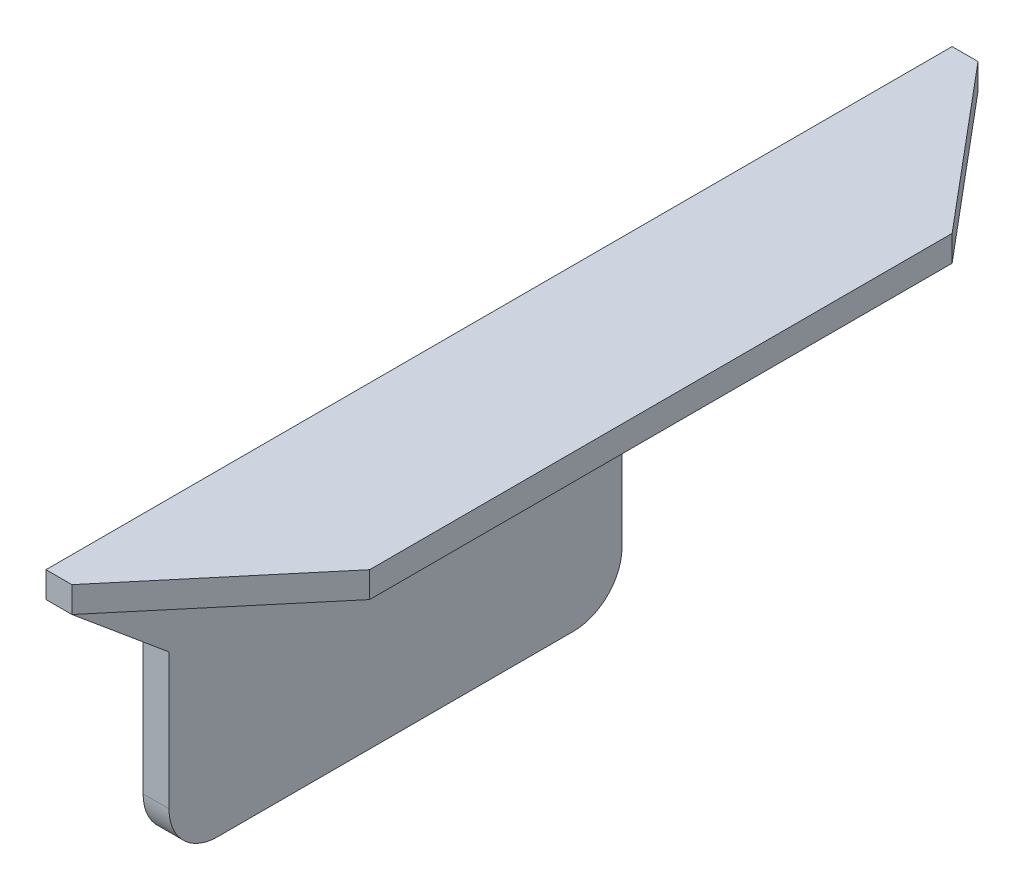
from build123d import *

# Parameters (mm, degrees)
EXTRUDE_1_DEPTH     = 280
CUT_EXTRUDE_1_DEPTH = 298.092578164
CUT_EXTRUDE_2_DEPTH = 280


with BuildPart() as part:
    # Sketch 1 → Extrude 1 (new body)
    with BuildSketch(Plane.XY):
        Polygon((50, 0), (0, 0), (0, -90), (8, -90), (8, -8), (50, -8), align=None)
    extrude(amount=EXTRUDE_1_DEPTH)

    # Sketch 2 → Cut-Extrude 1 (cut, through all)
    with BuildSketch(Plane(origin=(8, 0, 0), x_dir=(0, 0, -1), z_dir=(1, 0, 0))):
        with BuildLine():
            Line((-250, -33), (-280, -8))
            Line((-280, -8), (-280, -90))
            Line((-280, -90), (-235, -90))
            ThreePointArc((-235, -90), (-245.606601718, -85.606601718), (-250, -75))
            Line((-250, -75), (-250, -33))
        make_face()
        with BuildLine():
            Line((0, -90), (0, -8))
            Line((0, -8), (-40, -33))
            Line((-40, -33), (-110, -33))
            Line((-110, -33), (-110, -75))
            ThreePointArc((-110, -75), (-114.393398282, -85.606601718), (-125, -90))
            Line((-125, -90), (0, -90))
        make_face()
    extrude(amount=-CUT_EXTRUDE_1_DEPTH, mode=Mode.SUBTRACT)

    # Sketch 3 → Cut-Extrude 2 (cut)
    with BuildSketch(Plane.XZ.offset(8)):
        Polygon((50, 280), (8, 280), (50, 230), align=None)
        Polygon((50, 50), (8, 0), (50, 0), align=None)
    extrude(amount=-CUT_EXTRUDE_2_DEPTH, mode=Mode.SUBTRACT)


solid = part.part
